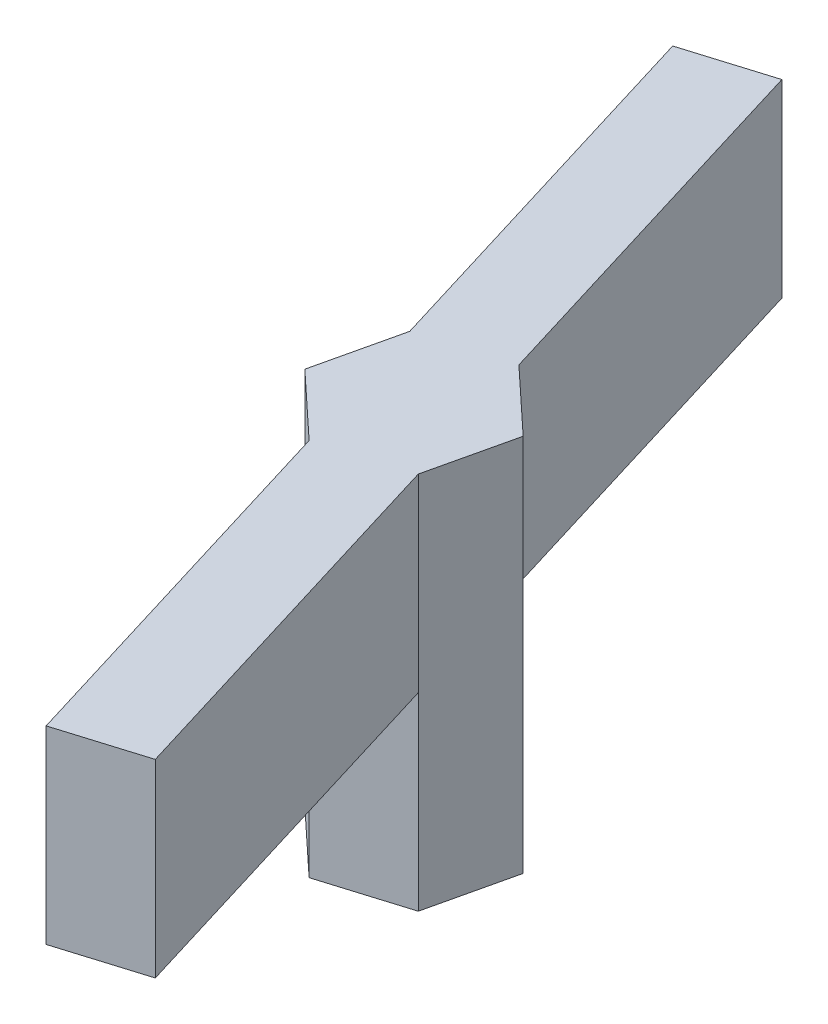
from build123d import *

# Parameters (mm, degrees)
BOSS_EXTRUDE1_DEPTH = 5
BOSS_EXTRUDE3_DEPTH = 5


with BuildPart() as part:
    # Sketch1 → Boss-Extrude1 (new body)
    with BuildSketch(Plane(origin=(0, 0, 0), x_dir=(1, 0, 0), z_dir=(0, 1, 0))):
        Polygon((1.688520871, -1.575509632), (2.208691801, 0.674547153), (0.520170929, 2.250056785), (-1.688520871, 1.575509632), (-2.208691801, -0.674547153), (-0.520170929, -2.250056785), align=None)
    extrude(amount=BOSS_EXTRUDE1_DEPTH)

    # Sketch2 → Boss-Extrude3 (add)
    with BuildSketch(Plane(origin=(0, 5, 0), x_dir=(1, 0, 0), z_dir=(0, 1, 0))):
        Polygon((-0.520170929, -2.250056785), (2.533886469, -12.250056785), (4.742578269, -11.575509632), (1.688520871, -1.575509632), (2.208691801, 0.674547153), (0.520170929, 2.250056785), (-2.533886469, 12.250056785), (-4.742578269, 11.575509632), (-1.688520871, 1.575509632), (-2.208691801, -0.674547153), align=None)
    extrude(amount=BOSS_EXTRUDE3_DEPTH)


solid = part.part
